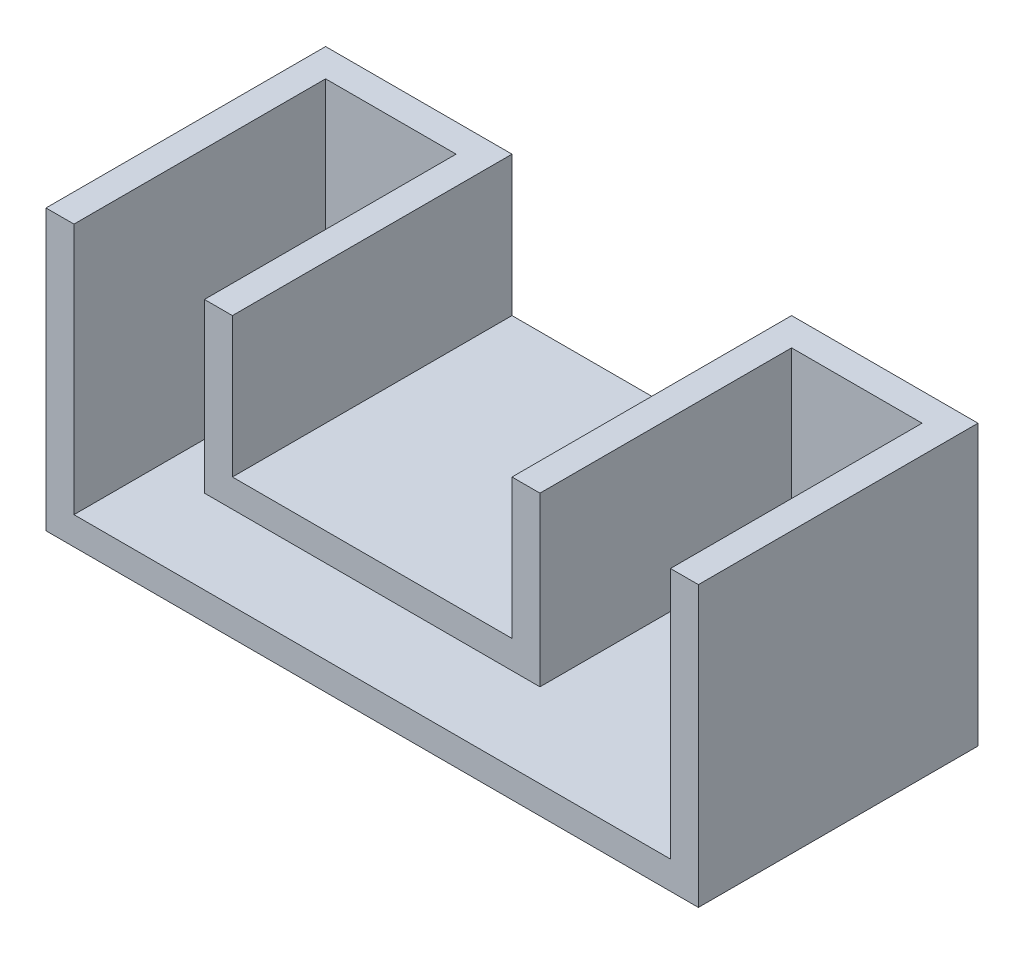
from build123d import *

# Parameters (mm, degrees)
EXTRUDE1_DEPTH = 15
SHELL1_T       = -3


with BuildPart() as part:
    # Sketch1 → Extrude1 (new, symmetric)
    with BuildSketch(Plane.XY):
        Polygon((0, 0), (0, 30), (20, 30), (20, 15), (50, 15), (50, 30), (70, 30), (70, 0), align=None)
    extrude(amount=EXTRUDE1_DEPTH, both=True)

    # Shell1
    shell1_openings = [part.faces().sort_by_distance(p)[0] for p in [
        (35, 12.954545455, 15),
        (10, 30, 0),
        (60, 30, 0),
    ]]
    offset(amount=SHELL1_T, openings=shell1_openings, kind=Kind.INTERSECTION)


solid = part.part
